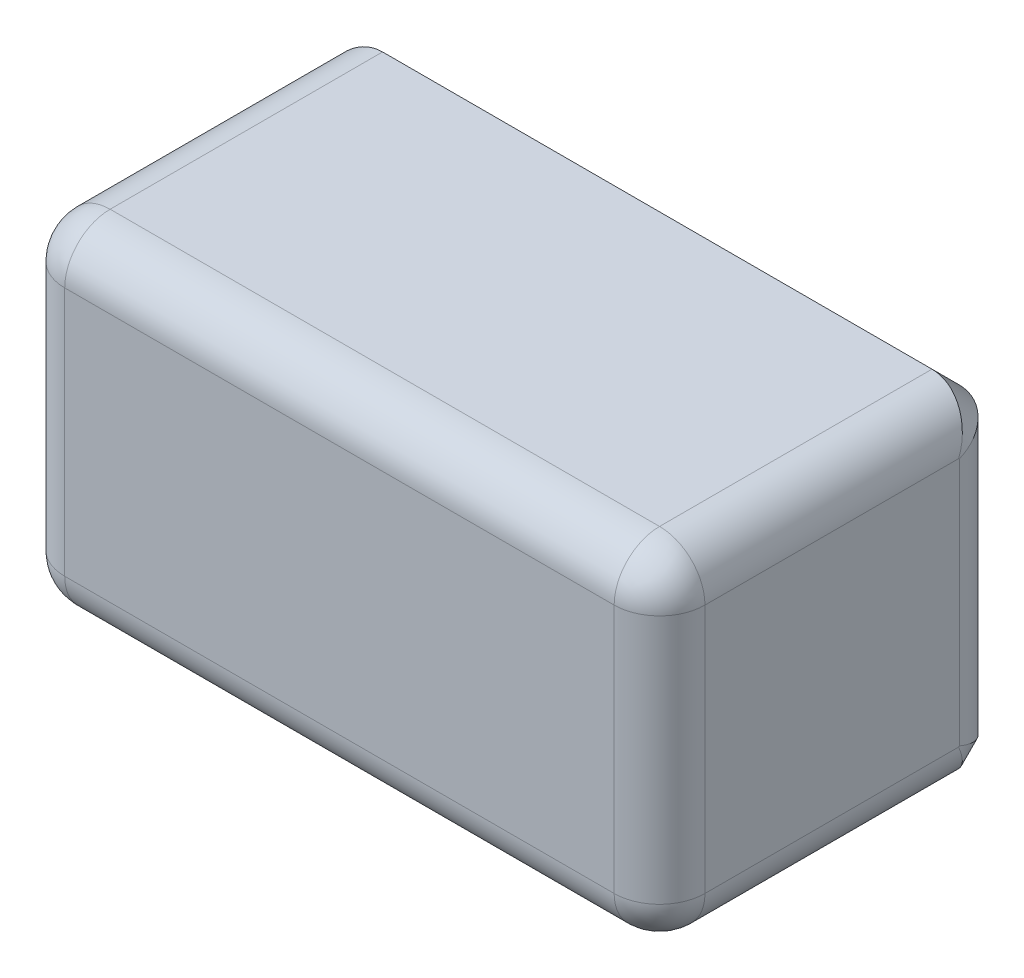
from build123d import *

# Parameters (mm, degrees)
AUFSATZ_LINEAR_AUSTRAGEN1_DEPTH      = 19
AUFSATZ_LINEAR_AUSTRAGEN1_DEPTH_BACK = 19
SKIZZE2_W                            = 70.5
SKIZZE2_H                            = 37.5
FASE1_SIZE                           = 3
VERRUNDUNG1_R                        = 5


with BuildPart() as part:
    # Skizze2 → Aufsatz-Linear austragen1 (new, two sides: drawn at the far end of the back side and taken through both)
    with BuildSketch(Plane.XY.offset(-AUFSATZ_LINEAR_AUSTRAGEN1_DEPTH_BACK)):
        Rectangle(SKIZZE2_W, SKIZZE2_H)
    extrude(amount=AUFSATZ_LINEAR_AUSTRAGEN1_DEPTH + AUFSATZ_LINEAR_AUSTRAGEN1_DEPTH_BACK)

    # Fase1
    fase1_edges = [part.edges().sort_by_distance(p)[0] for p in [
        (0, -18.75, -19),
        (0, 18.75, -19),
    ]]
    chamfer(fase1_edges, length=FASE1_SIZE)

    # Verrundung1
    verrundung1_edges = [part.edges().sort_by_distance(p)[0] for p in [
        (0, 18.75, 19),
        (-35.25, 0, 19),
        (0, -18.75, 19),
        (35.25, 0, 19),
        (-35.25, 18.75, 1.5),
        (35.25, 18.75, 1.5),
        (-35.25, -18.75, 1.5),
        (-35.25, 0, -19),
        (-35.25, -17.25, -17.5),
        (-35.25, 17.25, -17.5),
        (35.25, 0, -19),
        (35.25, -18.75, 1.5),
        (35.25, -17.25, -17.5),
        (35.25, 17.25, -17.5),
    ]]
    fillet(verrundung1_edges, radius=VERRUNDUNG1_R)


solid = part.part
